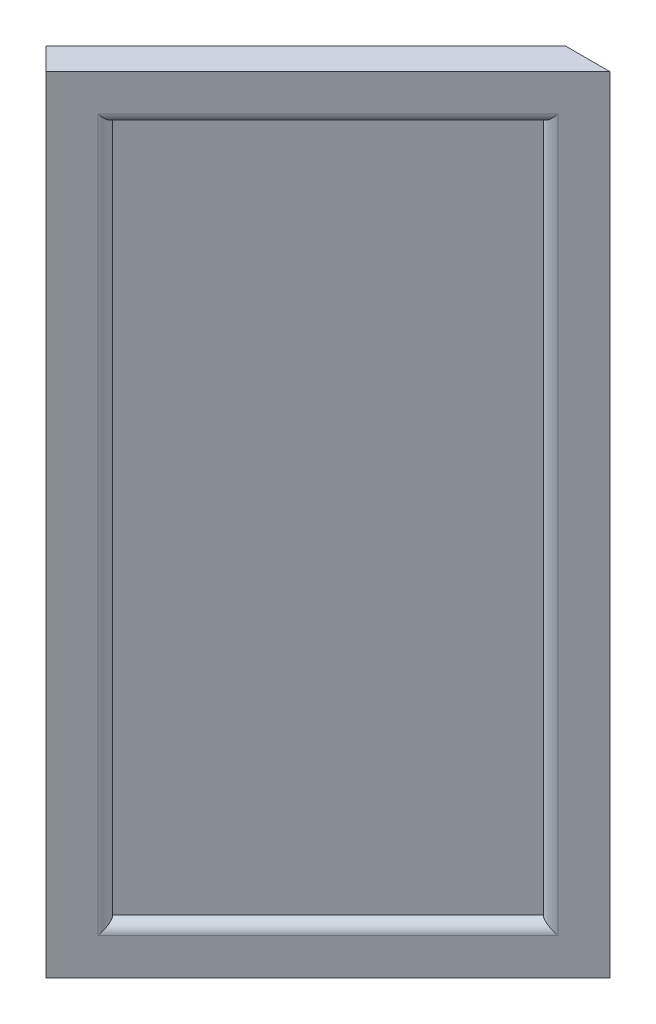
ISO-10303-21;
HEADER;
FILE_DESCRIPTION(('STEP AP214'),'2;1');
FILE_NAME('part.step','',(''),(''),'','','');
FILE_SCHEMA(('AUTOMOTIVE_DESIGN { 1 0 10303 214 1 1 1 1 }'));
ENDSEC;
DATA;
#1=APPLICATION_CONTEXT('core data for automotive mechanical design processes');
#2=APPLICATION_PROTOCOL_DEFINITION('international standard','automotive_design',2000,#1);
#3=PRODUCT_CONTEXT('',#1,'mechanical');
#4=PRODUCT('Part','Part','',(#3));
#5=PRODUCT_RELATED_PRODUCT_CATEGORY('part','',(#4));
#6=PRODUCT_DEFINITION_FORMATION('','',#4);
#7=PRODUCT_DEFINITION_CONTEXT('part definition',#1,'design');
#8=PRODUCT_DEFINITION('design','',#6,#7);
#9=PRODUCT_DEFINITION_SHAPE('','',#8);
#10=(LENGTH_UNIT() NAMED_UNIT(*) SI_UNIT(.MILLI.,.METRE.));
#11=(NAMED_UNIT(*) PLANE_ANGLE_UNIT() SI_UNIT($,.RADIAN.));
#12=(NAMED_UNIT(*) SI_UNIT($,.STERADIAN.) SOLID_ANGLE_UNIT());
#13=UNCERTAINTY_MEASURE_WITH_UNIT(LENGTH_MEASURE(1.E-05),#10,'distance_accuracy_value','');
#14=(GEOMETRIC_REPRESENTATION_CONTEXT(3) GLOBAL_UNCERTAINTY_ASSIGNED_CONTEXT((#13)) GLOBAL_UNIT_ASSIGNED_CONTEXT((#10,
#11,#12)) REPRESENTATION_CONTEXT('',''));
#15=CARTESIAN_POINT('',(0.,0.,0.));
#16=DIRECTION('',(0.,0.,1.));
#17=DIRECTION('',(1.,0.,0.));
#18=AXIS2_PLACEMENT_3D('',#15,#16,#17);
#19=CARTESIAN_POINT('',(13.4703841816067,2268.55502729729,-13.4703841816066));
#20=DIRECTION('',(0.70710678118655,0.,-0.707106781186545));
#21=DIRECTION('',(-0.707106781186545,0.,-0.70710678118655));
#22=AXIS2_PLACEMENT_3D('',#19,#20,#21);
#23=PLANE('',#22);
#24=DIRECTION('',(0.707106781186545,0.,0.70710678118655));
#25=VECTOR('',#24,1.);
#26=CARTESIAN_POINT('',(13.4703841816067,1765.3,-13.4703841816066));
#27=LINE('',#26,#25);
#28=CARTESIAN_POINT('',(697.729615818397,1765.3,670.788847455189));
#29=VERTEX_POINT('',#28);
#30=CARTESIAN_POINT('',(724.670384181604,1765.3,697.729615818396));
#31=VERTEX_POINT('',#30);
#32=EDGE_CURVE('E166',#29,#31,#27,.T.);
#33=ORIENTED_EDGE('',*,*,#32,.F.);
#34=DIRECTION('',(0.,-1.,0.));
#35=VECTOR('',#34,1.);
#36=CARTESIAN_POINT('',(697.729615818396,2268.55502729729,670.788847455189));
#37=LINE('',#36,#35);
#38=CARTESIAN_POINT('',(697.729615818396,812.8,670.788847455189));
#39=VERTEX_POINT('',#38);
#40=EDGE_CURVE('E140',#29,#39,#37,.T.);
#41=ORIENTED_EDGE('',*,*,#40,.T.);
#42=DIRECTION('',(0.707106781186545,0.,0.70710678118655));
#43=VECTOR('',#42,1.);
#44=CARTESIAN_POINT('',(13.4703841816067,812.8,-13.4703841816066));
#45=LINE('',#44,#43);
#46=CARTESIAN_POINT('',(724.670384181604,812.8,697.729615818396));
#47=VERTEX_POINT('',#46);
#48=EDGE_CURVE('E156',#39,#47,#45,.T.);
#49=ORIENTED_EDGE('',*,*,#48,.T.);
#50=DIRECTION('',(0.,-1.,0.));
#51=VECTOR('',#50,1.);
#52=CARTESIAN_POINT('',(724.670384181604,2268.55502729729,697.729615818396));
#53=LINE('',#52,#51);
#54=EDGE_CURVE('E155',#31,#47,#53,.T.);
#55=ORIENTED_EDGE('',*,*,#54,.F.);
#56=EDGE_LOOP('',(#33,#41,#49,#55));
#57=FACE_BOUND('',#56,.T.);
#58=ADVANCED_FACE('F49',(#57),#23,.F.);
#59=CARTESIAN_POINT('',(711.2,2268.55502729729,711.2));
#60=DIRECTION('',(-0.707106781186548,0.,-0.707106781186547));
#61=DIRECTION('',(-0.707106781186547,0.,0.707106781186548));
#62=AXIS2_PLACEMENT_3D('',#59,#60,#61);
#63=PLANE('',#62);
#64=DIRECTION('',(0.,-1.,0.));
#65=VECTOR('',#64,1.);
#66=CARTESIAN_POINT('',(756.101280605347,1720.85,666.298719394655));
#67=LINE('',#66,#65);
#68=CARTESIAN_POINT('',(756.101280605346,1720.85,666.298719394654));
#69=VERTEX_POINT('',#68);
#70=CARTESIAN_POINT('',(756.101280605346,857.25,666.298719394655));
#71=VERTEX_POINT('',#70);
#72=EDGE_CURVE('E126',#69,#71,#67,.T.);
#73=ORIENTED_EDGE('',*,*,#72,.F.);
#74=DIRECTION('',(-0.707106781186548,0.,0.707106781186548));
#75=VECTOR('',#74,1.);
#76=CARTESIAN_POINT('',(1035.36910357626,1720.85,387.030896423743));
#77=LINE('',#76,#75);
#78=CARTESIAN_POINT('',(1035.36910357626,1720.85,387.030896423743));
#79=VERTEX_POINT('',#78);
#80=EDGE_CURVE('E64',#79,#69,#77,.T.);
#81=ORIENTED_EDGE('',*,*,#80,.F.);
#82=DIRECTION('',(0.,1.,0.));
#83=VECTOR('',#82,1.);
#84=CARTESIAN_POINT('',(1035.36910357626,1720.85,387.030896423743));
#85=LINE('',#84,#83);
#86=CARTESIAN_POINT('',(1035.36910357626,857.25,387.030896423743));
#87=VERTEX_POINT('',#86);
#88=EDGE_CURVE('E133',#87,#79,#85,.T.);
#89=ORIENTED_EDGE('',*,*,#88,.F.);
#90=DIRECTION('',(0.707106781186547,0.,-0.707106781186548));
#91=VECTOR('',#90,1.);
#92=CARTESIAN_POINT('',(1035.36910357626,857.25,387.030896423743));
#93=LINE('',#92,#91);
#94=EDGE_CURVE('E117',#71,#87,#93,.T.);
#95=ORIENTED_EDGE('',*,*,#94,.F.);
#96=EDGE_LOOP('',(#73,#81,#89,#95));
#97=FACE_BOUND('',#96,.T.);
#98=DIRECTION('',(0.707106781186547,0.,-0.707106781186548));
#99=VECTOR('',#98,1.);
#100=CARTESIAN_POINT('',(711.2,1765.3,711.2));
#101=LINE('',#100,#99);
#102=CARTESIAN_POINT('',(1066.8,1765.3,355.6));
#103=VERTEX_POINT('',#102);
#104=EDGE_CURVE('E163',#31,#103,#101,.T.);
#105=ORIENTED_EDGE('',*,*,#104,.F.);
#106=ORIENTED_EDGE('',*,*,#54,.T.);
#107=DIRECTION('',(0.707106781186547,0.,-0.707106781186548));
#108=VECTOR('',#107,1.);
#109=CARTESIAN_POINT('',(711.2,812.8,711.2));
#110=LINE('',#109,#108);
#111=CARTESIAN_POINT('',(1066.8,812.8,355.6));
#112=VERTEX_POINT('',#111);
#113=EDGE_CURVE('E152',#47,#112,#110,.T.);
#114=ORIENTED_EDGE('',*,*,#113,.T.);
#115=DIRECTION('',(0.,-1.,0.));
#116=VECTOR('',#115,1.);
#117=CARTESIAN_POINT('',(1066.8,2268.55502729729,355.6));
#118=LINE('',#117,#116);
#119=EDGE_CURVE('E151',#103,#112,#118,.T.);
#120=ORIENTED_EDGE('',*,*,#119,.F.);
#121=EDGE_LOOP('',(#105,#106,#114,#120));
#122=FACE_BOUND('',#121,.T.);
#123=ADVANCED_FACE('F130',(#97,#122),#63,.F.);
#124=CARTESIAN_POINT('',(0.,2268.55502729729,355.6));
#125=DIRECTION('',(0.,0.,1.));
#126=DIRECTION('',(1.,0.,0.));
#127=AXIS2_PLACEMENT_3D('',#124,#125,#126);
#128=PLANE('',#127);
#129=DIRECTION('',(-1.,0.,0.));
#130=VECTOR('',#129,1.);
#131=CARTESIAN_POINT('',(0.,1765.3,355.6));
#132=LINE('',#131,#130);
#133=CARTESIAN_POINT('',(1012.91846327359,1765.3,355.6));
#134=VERTEX_POINT('',#133);
#135=EDGE_CURVE('E159',#103,#134,#132,.T.);
#136=ORIENTED_EDGE('',*,*,#135,.F.);
#137=ORIENTED_EDGE('',*,*,#119,.T.);
#138=DIRECTION('',(-1.,0.,0.));
#139=VECTOR('',#138,1.);
#140=CARTESIAN_POINT('',(0.,812.8,355.6));
#141=LINE('',#140,#139);
#142=CARTESIAN_POINT('',(1012.91846327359,812.8,355.6));
#143=VERTEX_POINT('',#142);
#144=EDGE_CURVE('E148',#112,#143,#141,.T.);
#145=ORIENTED_EDGE('',*,*,#144,.T.);
#146=DIRECTION('',(0.,-1.,0.));
#147=VECTOR('',#146,1.);
#148=CARTESIAN_POINT('',(1012.91846327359,2268.55502729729,355.6));
#149=LINE('',#148,#147);
#150=EDGE_CURVE('E147',#134,#143,#149,.T.);
#151=ORIENTED_EDGE('',*,*,#150,.F.);
#152=EDGE_LOOP('',(#136,#137,#145,#151));
#153=FACE_BOUND('',#152,.T.);
#154=ADVANCED_FACE('F200',(#153),#128,.F.);
#155=CARTESIAN_POINT('',(684.259231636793,2268.55502729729,684.259231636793));
#156=DIRECTION('',(0.707106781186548,0.,0.707106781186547));
#157=DIRECTION('',(0.707106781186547,0.,-0.707106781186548));
#158=AXIS2_PLACEMENT_3D('',#155,#156,#157);
#159=PLANE('',#158);
#160=DIRECTION('',(0.,1.,0.));
#161=VECTOR('',#160,1.);
#162=CARTESIAN_POINT('',(1008.42833521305,2268.55502729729,360.090128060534));
#163=LINE('',#162,#161);
#164=CARTESIAN_POINT('',(1008.42833521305,857.25,360.090128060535));
#165=VERTEX_POINT('',#164);
#166=CARTESIAN_POINT('',(1008.42833521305,1720.85,360.090128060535));
#167=VERTEX_POINT('',#166);
#168=EDGE_CURVE('E57',#165,#167,#163,.T.);
#169=ORIENTED_EDGE('',*,*,#168,.T.);
#170=DIRECTION('',(-0.707106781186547,0.,0.707106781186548));
#171=VECTOR('',#170,1.);
#172=CARTESIAN_POINT('',(684.259231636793,1720.85,684.259231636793));
#173=LINE('',#172,#171);
#174=CARTESIAN_POINT('',(729.160512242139,1720.85,639.357951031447));
#175=VERTEX_POINT('',#174);
#176=EDGE_CURVE('E12',#167,#175,#173,.T.);
#177=ORIENTED_EDGE('',*,*,#176,.T.);
#178=DIRECTION('',(0.,-1.,0.));
#179=VECTOR('',#178,1.);
#180=CARTESIAN_POINT('',(729.160512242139,2268.55502729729,639.357951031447));
#181=LINE('',#180,#179);
#182=CARTESIAN_POINT('',(729.160512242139,857.25,639.357951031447));
#183=VERTEX_POINT('',#182);
#184=EDGE_CURVE('E162',#175,#183,#181,.T.);
#185=ORIENTED_EDGE('',*,*,#184,.T.);
#186=DIRECTION('',(0.707106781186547,0.,-0.707106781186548));
#187=VECTOR('',#186,1.);
#188=CARTESIAN_POINT('',(684.259231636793,857.25,684.259231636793));
#189=LINE('',#188,#187);
#190=EDGE_CURVE('E120',#183,#165,#189,.T.);
#191=ORIENTED_EDGE('',*,*,#190,.T.);
#192=EDGE_LOOP('',(#169,#177,#185,#191));
#193=FACE_BOUND('',#192,.T.);
#194=DIRECTION('',(-0.707106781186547,0.,0.707106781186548));
#195=VECTOR('',#194,1.);
#196=CARTESIAN_POINT('',(684.259231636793,1765.3,684.259231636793));
#197=LINE('',#196,#195);
#198=EDGE_CURVE('E146',#134,#29,#197,.T.);
#199=ORIENTED_EDGE('',*,*,#198,.F.);
#200=ORIENTED_EDGE('',*,*,#150,.T.);
#201=DIRECTION('',(-0.707106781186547,0.,0.707106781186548));
#202=VECTOR('',#201,1.);
#203=CARTESIAN_POINT('',(684.259231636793,812.8,684.259231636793));
#204=LINE('',#203,#202);
#205=EDGE_CURVE('E143',#143,#39,#204,.T.);
#206=ORIENTED_EDGE('',*,*,#205,.T.);
#207=ORIENTED_EDGE('',*,*,#40,.F.);
#208=EDGE_LOOP('',(#199,#200,#206,#207));
#209=FACE_BOUND('',#208,.T.);
#210=ADVANCED_FACE('F178',(#193,#209),#159,.F.);
#211=CARTESIAN_POINT('',(0.,812.8,0.));
#212=DIRECTION('',(0.,1.,0.));
#213=DIRECTION('',(0.,0.,1.));
#214=AXIS2_PLACEMENT_3D('',#211,#212,#213);
#215=PLANE('',#214);
#216=ORIENTED_EDGE('',*,*,#48,.F.);
#217=ORIENTED_EDGE('',*,*,#205,.F.);
#218=ORIENTED_EDGE('',*,*,#144,.F.);
#219=ORIENTED_EDGE('',*,*,#113,.F.);
#220=EDGE_LOOP('',(#216,#217,#218,#219));
#221=FACE_BOUND('',#220,.T.);
#222=ADVANCED_FACE('F191',(#221),#215,.F.);
#223=CARTESIAN_POINT('',(0.,1765.3,0.));
#224=DIRECTION('',(0.,1.,0.));
#225=DIRECTION('',(0.,0.,1.));
#226=AXIS2_PLACEMENT_3D('',#223,#224,#225);
#227=PLANE('',#226);
#228=ORIENTED_EDGE('',*,*,#198,.T.);
#229=ORIENTED_EDGE('',*,*,#32,.T.);
#230=ORIENTED_EDGE('',*,*,#104,.T.);
#231=ORIENTED_EDGE('',*,*,#135,.T.);
#232=EDGE_LOOP('',(#228,#229,#230,#231));
#233=FACE_BOUND('',#232,.T.);
#234=ADVANCED_FACE('F51',(#233),#227,.T.);
#235=CARTESIAN_POINT('',(1004.83623276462,1720.85,356.498025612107));
#236=DIRECTION('',(0.,1.,0.));
#237=DIRECTION('',(0.,0.,1.));
#238=AXIS2_PLACEMENT_3D('',#235,#236,#237);
#239=PLANE('',#238);
#240=DIRECTION('',(0.707106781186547,0.,0.707106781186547));
#241=VECTOR('',#240,1.);
#242=CARTESIAN_POINT('',(1004.83623276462,1720.85,356.498025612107));
#243=LINE('',#242,#241);
#244=EDGE_CURVE('E138',#167,#79,#243,.T.);
#245=ORIENTED_EDGE('',*,*,#244,.T.);
#246=ORIENTED_EDGE('',*,*,#80,.T.);
#247=DIRECTION('',(0.707106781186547,0.,0.707106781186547));
#248=VECTOR('',#247,1.);
#249=CARTESIAN_POINT('',(725.568409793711,1720.85,635.76584858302));
#250=LINE('',#249,#248);
#251=EDGE_CURVE('E123',#175,#69,#250,.T.);
#252=ORIENTED_EDGE('',*,*,#251,.F.);
#253=ORIENTED_EDGE('',*,*,#176,.F.);
#254=EDGE_LOOP('',(#245,#246,#252,#253));
#255=FACE_BOUND('',#254,.T.);
#256=ADVANCED_FACE('F183',(#255),#239,.F.);
#257=CARTESIAN_POINT('',(1004.83623276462,1720.85,356.498025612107));
#258=DIRECTION('',(0.707106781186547,0.,-0.707106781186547));
#259=DIRECTION('',(-0.707106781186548,0.,-0.707106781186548));
#260=AXIS2_PLACEMENT_3D('',#257,#258,#259);
#261=PLANE('',#260);
#262=DIRECTION('',(0.707106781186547,0.,0.707106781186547));
#263=VECTOR('',#262,1.);
#264=CARTESIAN_POINT('',(1004.83623276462,857.25,356.498025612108));
#265=LINE('',#264,#263);
#266=EDGE_CURVE('E122',#165,#87,#265,.T.);
#267=ORIENTED_EDGE('',*,*,#266,.T.);
#268=ORIENTED_EDGE('',*,*,#88,.T.);
#269=ORIENTED_EDGE('',*,*,#244,.F.);
#270=ORIENTED_EDGE('',*,*,#168,.F.);
#271=EDGE_LOOP('',(#267,#268,#269,#270));
#272=FACE_BOUND('',#271,.T.);
#273=ADVANCED_FACE('F182',(#272),#261,.F.);
#274=CARTESIAN_POINT('',(1004.83623276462,857.25,356.498025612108));
#275=DIRECTION('',(0.,-1.,0.));
#276=DIRECTION('',(0.,0.,-1.));
#277=AXIS2_PLACEMENT_3D('',#274,#275,#276);
#278=PLANE('',#277);
#279=DIRECTION('',(0.707106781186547,0.,0.707106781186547));
#280=VECTOR('',#279,1.);
#281=CARTESIAN_POINT('',(725.568409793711,857.25,635.76584858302));
#282=LINE('',#281,#280);
#283=EDGE_CURVE('E72',#183,#71,#282,.T.);
#284=ORIENTED_EDGE('',*,*,#283,.T.);
#285=ORIENTED_EDGE('',*,*,#94,.T.);
#286=ORIENTED_EDGE('',*,*,#266,.F.);
#287=ORIENTED_EDGE('',*,*,#190,.F.);
#288=EDGE_LOOP('',(#284,#285,#286,#287));
#289=FACE_BOUND('',#288,.T.);
#290=ADVANCED_FACE('F114',(#289),#278,.F.);
#291=CARTESIAN_POINT('',(725.568409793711,1720.85,635.76584858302));
#292=DIRECTION('',(-0.707106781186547,0.,0.707106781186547));
#293=DIRECTION('',(0.707106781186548,0.,0.707106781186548));
#294=AXIS2_PLACEMENT_3D('',#291,#292,#293);
#295=PLANE('',#294);
#296=ORIENTED_EDGE('',*,*,#251,.T.);
#297=ORIENTED_EDGE('',*,*,#72,.T.);
#298=ORIENTED_EDGE('',*,*,#283,.F.);
#299=ORIENTED_EDGE('',*,*,#184,.F.);
#300=EDGE_LOOP('',(#296,#297,#298,#299));
#301=FACE_BOUND('',#300,.T.);
#302=ADVANCED_FACE('F127',(#301),#295,.F.);
#303=CLOSED_SHELL('',(#58,#123,#154,#210,#222,#234,#256,#273,#290,#302));
#304=MANIFOLD_SOLID_BREP('B2',#303);
#305=CARTESIAN_POINT('',(738.140768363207,1720.85,648.338207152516));
#306=DIRECTION('',(0.,1.,0.));
#307=DIRECTION('',(0.,0.,1.));
#308=AXIS2_PLACEMENT_3D('',#305,#306,#307);
#309=PLANE('',#308);
#310=DIRECTION('',(0.707106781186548,0.,-0.707106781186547));
#311=VECTOR('',#310,1.);
#312=CARTESIAN_POINT('',(729.160512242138,1720.85,639.357951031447));
#313=LINE('',#312,#311);
#314=CARTESIAN_POINT('',(729.160512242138,1720.85,639.357951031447));
#315=VERTEX_POINT('',#314);
#316=CARTESIAN_POINT('',(1008.42833521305,1720.85,360.090128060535));
#317=VERTEX_POINT('',#316);
#318=EDGE_CURVE('E376',#315,#317,#313,.T.);
#319=ORIENTED_EDGE('',*,*,#318,.F.);
#320=DIRECTION('',(-0.707106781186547,0.,-0.707106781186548));
#321=VECTOR('',#320,1.);
#322=CARTESIAN_POINT('',(738.140768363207,1720.85,648.338207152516));
#323=LINE('',#322,#321);
#324=CARTESIAN_POINT('',(738.140768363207,1720.85,648.338207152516));
#325=VERTEX_POINT('',#324);
#326=EDGE_CURVE('E47',#325,#315,#323,.T.);
#327=ORIENTED_EDGE('',*,*,#326,.F.);
#328=DIRECTION('',(0.707106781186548,0.,-0.707106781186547));
#329=VECTOR('',#328,1.);
#330=CARTESIAN_POINT('',(738.140768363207,1720.85,648.338207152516));
#331=LINE('',#330,#329);
#332=CARTESIAN_POINT('',(1017.40859133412,1720.85,369.070384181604));
#333=VERTEX_POINT('',#332);
#334=EDGE_CURVE('E377',#325,#333,#331,.T.);
#335=ORIENTED_EDGE('',*,*,#334,.T.);
#336=DIRECTION('',(-0.707106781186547,0.,-0.707106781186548));
#337=VECTOR('',#336,1.);
#338=CARTESIAN_POINT('',(1017.40859133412,1720.85,369.070384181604));
#339=LINE('',#338,#337);
#340=EDGE_CURVE('E338',#333,#317,#339,.T.);
#341=ORIENTED_EDGE('',*,*,#340,.T.);
#342=EDGE_LOOP('',(#319,#327,#335,#341));
#343=FACE_BOUND('',#342,.T.);
#344=ADVANCED_FACE('F288',(#343),#309,.T.);
#345=CARTESIAN_POINT('',(738.140768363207,1720.85,648.338207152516));
#346=DIRECTION('',(-0.707106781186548,0.,0.707106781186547));
#347=DIRECTION('',(0.707106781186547,0.,0.707106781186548));
#348=AXIS2_PLACEMENT_3D('',#345,#346,#347);
#349=PLANE('',#348);
#350=DIRECTION('',(0.,1.,0.));
#351=VECTOR('',#350,1.);
#352=CARTESIAN_POINT('',(729.160512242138,1720.85,639.357951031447));
#353=LINE('',#352,#351);
#354=CARTESIAN_POINT('',(729.160512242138,857.25,639.357951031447));
#355=VERTEX_POINT('',#354);
#356=EDGE_CURVE('E380',#355,#315,#353,.T.);
#357=ORIENTED_EDGE('',*,*,#356,.F.);
#358=DIRECTION('',(-0.707106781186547,0.,-0.707106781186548));
#359=VECTOR('',#358,1.);
#360=CARTESIAN_POINT('',(738.140768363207,857.25,648.338207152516));
#361=LINE('',#360,#359);
#362=CARTESIAN_POINT('',(738.140768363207,857.25,648.338207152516));
#363=VERTEX_POINT('',#362);
#364=EDGE_CURVE('E297',#363,#355,#361,.T.);
#365=ORIENTED_EDGE('',*,*,#364,.F.);
#366=DIRECTION('',(0.,1.,0.));
#367=VECTOR('',#366,1.);
#368=CARTESIAN_POINT('',(738.140768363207,1720.85,648.338207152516));
#369=LINE('',#368,#367);
#370=EDGE_CURVE('E385',#363,#325,#369,.T.);
#371=ORIENTED_EDGE('',*,*,#370,.T.);
#372=ORIENTED_EDGE('',*,*,#326,.T.);
#373=EDGE_LOOP('',(#357,#365,#371,#372));
#374=FACE_BOUND('',#373,.T.);
#375=ADVANCED_FACE('F408',(#374),#349,.T.);
#376=CARTESIAN_POINT('',(738.140768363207,857.25,648.338207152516));
#377=DIRECTION('',(0.,-1.,0.));
#378=DIRECTION('',(0.,0.,-1.));
#379=AXIS2_PLACEMENT_3D('',#376,#377,#378);
#380=PLANE('',#379);
#381=DIRECTION('',(-0.707106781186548,0.,0.707106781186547));
#382=VECTOR('',#381,1.);
#383=CARTESIAN_POINT('',(729.160512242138,857.25,639.357951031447));
#384=LINE('',#383,#382);
#385=CARTESIAN_POINT('',(1008.42833521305,857.25,360.090128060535));
#386=VERTEX_POINT('',#385);
#387=EDGE_CURVE('E390',#386,#355,#384,.T.);
#388=ORIENTED_EDGE('',*,*,#387,.F.);
#389=DIRECTION('',(-0.707106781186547,0.,-0.707106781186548));
#390=VECTOR('',#389,1.);
#391=CARTESIAN_POINT('',(1017.40859133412,857.25,369.070384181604));
#392=LINE('',#391,#390);
#393=CARTESIAN_POINT('',(1017.40859133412,857.25,369.070384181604));
#394=VERTEX_POINT('',#393);
#395=EDGE_CURVE('E395',#394,#386,#392,.T.);
#396=ORIENTED_EDGE('',*,*,#395,.F.);
#397=DIRECTION('',(-0.707106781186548,0.,0.707106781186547));
#398=VECTOR('',#397,1.);
#399=CARTESIAN_POINT('',(738.140768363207,857.25,648.338207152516));
#400=LINE('',#399,#398);
#401=EDGE_CURVE('E382',#394,#363,#400,.T.);
#402=ORIENTED_EDGE('',*,*,#401,.T.);
#403=ORIENTED_EDGE('',*,*,#364,.T.);
#404=EDGE_LOOP('',(#388,#396,#402,#403));
#405=FACE_BOUND('',#404,.T.);
#406=ADVANCED_FACE('F406',(#405),#380,.T.);
#407=CARTESIAN_POINT('',(1017.40859133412,1720.85,369.070384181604));
#408=DIRECTION('',(0.707106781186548,0.,-0.707106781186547));
#409=DIRECTION('',(-0.707106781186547,0.,-0.707106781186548));
#410=AXIS2_PLACEMENT_3D('',#407,#408,#409);
#411=PLANE('',#410);
#412=DIRECTION('',(0.,-1.,0.));
#413=VECTOR('',#412,1.);
#414=CARTESIAN_POINT('',(1008.42833521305,1720.85,360.090128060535));
#415=LINE('',#414,#413);
#416=EDGE_CURVE('E366',#317,#386,#415,.T.);
#417=ORIENTED_EDGE('',*,*,#416,.F.);
#418=ORIENTED_EDGE('',*,*,#340,.F.);
#419=DIRECTION('',(0.,-1.,0.));
#420=VECTOR('',#419,1.);
#421=CARTESIAN_POINT('',(1017.40859133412,1720.85,369.070384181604));
#422=LINE('',#421,#420);
#423=EDGE_CURVE('E379',#333,#394,#422,.T.);
#424=ORIENTED_EDGE('',*,*,#423,.T.);
#425=ORIENTED_EDGE('',*,*,#395,.T.);
#426=EDGE_LOOP('',(#417,#418,#424,#425));
#427=FACE_BOUND('',#426,.T.);
#428=ADVANCED_FACE('F402',(#427),#411,.T.);
#429=CARTESIAN_POINT('',(693.239487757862,0.,693.239487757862));
#430=DIRECTION('',(-0.707106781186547,0.,-0.707106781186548));
#431=DIRECTION('',(-0.707106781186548,0.,0.707106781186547));
#432=AXIS2_PLACEMENT_3D('',#429,#430,#431);
#433=PLANE('',#432);
#434=DIRECTION('',(0.707106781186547,0.,-0.707106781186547));
#435=VECTOR('',#434,1.);
#436=CARTESIAN_POINT('',(747.121024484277,1708.15,639.357951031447));
#437=LINE('',#436,#435);
#438=CARTESIAN_POINT('',(747.121024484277,1708.15,639.357951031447));
#439=VERTEX_POINT('',#438);
#440=CARTESIAN_POINT('',(1008.42833521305,1708.15,378.050640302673));
#441=VERTEX_POINT('',#440);
#442=EDGE_CURVE('E358',#439,#441,#437,.T.);
#443=ORIENTED_EDGE('',*,*,#442,.T.);
#444=DIRECTION('',(0.,-1.,0.));
#445=VECTOR('',#444,1.);
#446=CARTESIAN_POINT('',(1008.42833521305,1708.15,378.050640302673));
#447=LINE('',#446,#445);
#448=CARTESIAN_POINT('',(1008.42833521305,869.95,378.050640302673));
#449=VERTEX_POINT('',#448);
#450=EDGE_CURVE('E352',#441,#449,#447,.T.);
#451=ORIENTED_EDGE('',*,*,#450,.T.);
#452=DIRECTION('',(-0.707106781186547,0.,0.707106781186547));
#453=VECTOR('',#452,1.);
#454=CARTESIAN_POINT('',(747.121024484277,869.95,639.357951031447));
#455=LINE('',#454,#453);
#456=CARTESIAN_POINT('',(747.121024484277,869.95,639.357951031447));
#457=VERTEX_POINT('',#456);
#458=EDGE_CURVE('E356',#449,#457,#455,.T.);
#459=ORIENTED_EDGE('',*,*,#458,.T.);
#460=DIRECTION('',(0.,1.,0.));
#461=VECTOR('',#460,1.);
#462=CARTESIAN_POINT('',(747.121024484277,1708.15,639.357951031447));
#463=LINE('',#462,#461);
#464=EDGE_CURVE('E371',#457,#439,#463,.T.);
#465=ORIENTED_EDGE('',*,*,#464,.T.);
#466=EDGE_LOOP('',(#443,#451,#459,#465));
#467=FACE_BOUND('',#466,.T.);
#468=ORIENTED_EDGE('',*,*,#334,.F.);
#469=ORIENTED_EDGE('',*,*,#370,.F.);
#470=ORIENTED_EDGE('',*,*,#401,.F.);
#471=ORIENTED_EDGE('',*,*,#423,.F.);
#472=EDGE_LOOP('',(#468,#469,#470,#471));
#473=FACE_BOUND('',#472,.T.);
#474=ADVANCED_FACE('F354',(#467,#473),#433,.F.);
#475=CARTESIAN_POINT('',(747.121024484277,1720.85,639.357951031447));
#476=DIRECTION('',(-0.707106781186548,0.,0.707106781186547));
#477=DIRECTION('',(0.707106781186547,0.,0.707106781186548));
#478=AXIS2_PLACEMENT_3D('',#475,#476,#477);
#479=CYLINDRICAL_SURFACE('',#478,12.7);
#480=CARTESIAN_POINT('',(738.140768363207,1720.85,648.338207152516));
#481=DIRECTION('',(-0.5,-0.707106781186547,0.5));
#482=DIRECTION('',(0.5,-0.707106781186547,-0.5));
#483=AXIS2_PLACEMENT_3D('',#480,#481,#482);
#484=ELLIPSE('',#483,17.9605122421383,12.7);
#485=EDGE_CURVE('E368',#315,#439,#484,.T.);
#486=ORIENTED_EDGE('',*,*,#485,.F.);
#487=ORIENTED_EDGE('',*,*,#318,.T.);
#488=CARTESIAN_POINT('',(1017.40859133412,1720.85,369.070384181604));
#489=DIRECTION('',(-0.5,0.707106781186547,0.5));
#490=DIRECTION('',(0.5,0.707106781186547,-0.5));
#491=AXIS2_PLACEMENT_3D('',#488,#489,#490);
#492=ELLIPSE('',#491,17.9605122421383,12.7);
#493=EDGE_CURVE('E292',#441,#317,#492,.F.);
#494=ORIENTED_EDGE('',*,*,#493,.F.);
#495=ORIENTED_EDGE('',*,*,#442,.F.);
#496=EDGE_LOOP('',(#486,#487,#494,#495));
#497=FACE_BOUND('',#496,.T.);
#498=ADVANCED_FACE('F290',(#497),#479,.T.);
#499=CARTESIAN_POINT('',(1017.40859133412,1708.15,369.070384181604));
#500=DIRECTION('',(0.,1.,0.));
#501=DIRECTION('',(0.,0.,1.));
#502=AXIS2_PLACEMENT_3D('',#499,#500,#501);
#503=CYLINDRICAL_SURFACE('',#502,12.7);
#504=ORIENTED_EDGE('',*,*,#493,.T.);
#505=ORIENTED_EDGE('',*,*,#416,.T.);
#506=CARTESIAN_POINT('',(1017.40859133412,857.25,369.070384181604));
#507=DIRECTION('',(0.5,0.707106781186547,-0.5));
#508=DIRECTION('',(0.5,-0.707106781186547,-0.5));
#509=AXIS2_PLACEMENT_3D('',#506,#507,#508);
#510=ELLIPSE('',#509,17.9605122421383,12.7);
#511=EDGE_CURVE('E364',#449,#386,#510,.F.);
#512=ORIENTED_EDGE('',*,*,#511,.F.);
#513=ORIENTED_EDGE('',*,*,#450,.F.);
#514=EDGE_LOOP('',(#504,#505,#512,#513));
#515=FACE_BOUND('',#514,.T.);
#516=ADVANCED_FACE('F365',(#515),#503,.T.);
#517=CARTESIAN_POINT('',(738.140768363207,1708.15,648.338207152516));
#518=DIRECTION('',(0.,-1.,0.));
#519=DIRECTION('',(0.,0.,-1.));
#520=AXIS2_PLACEMENT_3D('',#517,#518,#519);
#521=CYLINDRICAL_SURFACE('',#520,12.7);
#522=ORIENTED_EDGE('',*,*,#485,.T.);
#523=ORIENTED_EDGE('',*,*,#464,.F.);
#524=CARTESIAN_POINT('',(738.140768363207,857.25,648.338207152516));
#525=DIRECTION('',(0.5,-0.707106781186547,-0.5));
#526=DIRECTION('',(0.5,0.707106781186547,-0.5));
#527=AXIS2_PLACEMENT_3D('',#524,#525,#526);
#528=ELLIPSE('',#527,17.9605122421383,12.7);
#529=EDGE_CURVE('E305',#355,#457,#528,.T.);
#530=ORIENTED_EDGE('',*,*,#529,.F.);
#531=ORIENTED_EDGE('',*,*,#356,.T.);
#532=EDGE_LOOP('',(#522,#523,#530,#531));
#533=FACE_BOUND('',#532,.T.);
#534=ADVANCED_FACE('F407',(#533),#521,.T.);
#535=CARTESIAN_POINT('',(747.121024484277,857.25,639.357951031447));
#536=DIRECTION('',(0.707106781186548,0.,-0.707106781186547));
#537=DIRECTION('',(-0.707106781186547,0.,-0.707106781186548));
#538=AXIS2_PLACEMENT_3D('',#535,#536,#537);
#539=CYLINDRICAL_SURFACE('',#538,12.7);
#540=ORIENTED_EDGE('',*,*,#511,.T.);
#541=ORIENTED_EDGE('',*,*,#387,.T.);
#542=ORIENTED_EDGE('',*,*,#529,.T.);
#543=ORIENTED_EDGE('',*,*,#458,.F.);
#544=EDGE_LOOP('',(#540,#541,#542,#543));
#545=FACE_BOUND('',#544,.T.);
#546=ADVANCED_FACE('F370',(#545),#539,.T.);
#547=CLOSED_SHELL('',(#344,#375,#406,#428,#474,#498,#516,#534,#546));
#548=MANIFOLD_SOLID_BREP('B6',#547);
#549=CARTESIAN_POINT('',(747.121024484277,857.25,657.318463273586));
#550=DIRECTION('',(0.707106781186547,0.,-0.707106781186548));
#551=DIRECTION('',(-0.707106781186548,0.,-0.707106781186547));
#552=AXIS2_PLACEMENT_3D('',#549,#550,#551);
#553=PLANE('',#552);
#554=DIRECTION('',(0.,-1.,0.));
#555=VECTOR('',#554,1.);
#556=CARTESIAN_POINT('',(738.140768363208,857.25,648.338207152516));
#557=LINE('',#556,#555);
#558=CARTESIAN_POINT('',(738.140768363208,1720.85,648.338207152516));
#559=VERTEX_POINT('',#558);
#560=CARTESIAN_POINT('',(738.140768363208,857.25,648.338207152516));
#561=VERTEX_POINT('',#560);
#562=EDGE_CURVE('E555',#559,#561,#557,.T.);
#563=ORIENTED_EDGE('',*,*,#562,.T.);
#564=DIRECTION('',(-0.707106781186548,0.,-0.707106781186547));
#565=VECTOR('',#564,1.);
#566=CARTESIAN_POINT('',(747.121024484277,857.25,657.318463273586));
#567=LINE('',#566,#565);
#568=CARTESIAN_POINT('',(747.121024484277,857.25,657.318463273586));
#569=VERTEX_POINT('',#568);
#570=EDGE_CURVE('E286',#569,#561,#567,.T.);
#571=ORIENTED_EDGE('',*,*,#570,.F.);
#572=DIRECTION('',(0.,-1.,0.));
#573=VECTOR('',#572,1.);
#574=CARTESIAN_POINT('',(747.121024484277,857.25,657.318463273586));
#575=LINE('',#574,#573);
#576=CARTESIAN_POINT('',(747.121024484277,1720.85,657.318463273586));
#577=VERTEX_POINT('',#576);
#578=EDGE_CURVE('E543',#577,#569,#575,.T.);
#579=ORIENTED_EDGE('',*,*,#578,.F.);
#580=DIRECTION('',(-0.707106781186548,0.,-0.707106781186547));
#581=VECTOR('',#580,1.);
#582=CARTESIAN_POINT('',(747.121024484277,1720.85,657.318463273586));
#583=LINE('',#582,#581);
#584=EDGE_CURVE('E551',#577,#559,#583,.T.);
#585=ORIENTED_EDGE('',*,*,#584,.T.);
#586=EDGE_LOOP('',(#563,#571,#579,#585));
#587=FACE_BOUND('',#586,.T.);
#588=ADVANCED_FACE('F492',(#587),#553,.F.);
#589=CARTESIAN_POINT('',(747.121024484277,857.25,657.318463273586));
#590=DIRECTION('',(0.,1.,0.));
#591=DIRECTION('',(0.,0.,1.));
#592=AXIS2_PLACEMENT_3D('',#589,#590,#591);
#593=PLANE('',#592);
#594=DIRECTION('',(0.707106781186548,0.,-0.707106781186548));
#595=VECTOR('',#594,1.);
#596=CARTESIAN_POINT('',(738.140768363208,857.25,648.338207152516));
#597=LINE('',#596,#595);
#598=CARTESIAN_POINT('',(1017.40859133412,857.25,369.070384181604));
#599=VERTEX_POINT('',#598);
#600=EDGE_CURVE('E547',#561,#599,#597,.T.);
#601=ORIENTED_EDGE('',*,*,#600,.T.);
#602=DIRECTION('',(-0.707106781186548,0.,-0.707106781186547));
#603=VECTOR('',#602,1.);
#604=CARTESIAN_POINT('',(1026.38884745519,857.25,378.050640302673));
#605=LINE('',#604,#603);
#606=CARTESIAN_POINT('',(1026.38884745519,857.25,378.050640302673));
#607=VERTEX_POINT('',#606);
#608=EDGE_CURVE('E500',#607,#599,#605,.T.);
#609=ORIENTED_EDGE('',*,*,#608,.F.);
#610=DIRECTION('',(0.707106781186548,0.,-0.707106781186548));
#611=VECTOR('',#610,1.);
#612=CARTESIAN_POINT('',(747.121024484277,857.25,657.318463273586));
#613=LINE('',#612,#611);
#614=EDGE_CURVE('E538',#569,#607,#613,.T.);
#615=ORIENTED_EDGE('',*,*,#614,.F.);
#616=ORIENTED_EDGE('',*,*,#570,.T.);
#617=EDGE_LOOP('',(#601,#609,#615,#616));
#618=FACE_BOUND('',#617,.T.);
#619=ADVANCED_FACE('F546',(#618),#593,.F.);
#620=CARTESIAN_POINT('',(1026.38884745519,857.25,378.050640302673));
#621=DIRECTION('',(-0.707106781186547,0.,0.707106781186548));
#622=DIRECTION('',(0.707106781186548,0.,0.707106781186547));
#623=AXIS2_PLACEMENT_3D('',#620,#621,#622);
#624=PLANE('',#623);
#625=DIRECTION('',(0.,1.,0.));
#626=VECTOR('',#625,1.);
#627=CARTESIAN_POINT('',(1017.40859133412,857.25,369.070384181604));
#628=LINE('',#627,#626);
#629=CARTESIAN_POINT('',(1017.40859133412,1720.85,369.070384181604));
#630=VERTEX_POINT('',#629);
#631=EDGE_CURVE('E525',#599,#630,#628,.T.);
#632=ORIENTED_EDGE('',*,*,#631,.T.);
#633=DIRECTION('',(-0.707106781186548,0.,-0.707106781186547));
#634=VECTOR('',#633,1.);
#635=CARTESIAN_POINT('',(1026.38884745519,1720.85,378.050640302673));
#636=LINE('',#635,#634);
#637=CARTESIAN_POINT('',(1026.38884745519,1720.85,378.050640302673));
#638=VERTEX_POINT('',#637);
#639=EDGE_CURVE('E548',#638,#630,#636,.T.);
#640=ORIENTED_EDGE('',*,*,#639,.F.);
#641=DIRECTION('',(0.,1.,0.));
#642=VECTOR('',#641,1.);
#643=CARTESIAN_POINT('',(1026.38884745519,857.25,378.050640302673));
#644=LINE('',#643,#642);
#645=EDGE_CURVE('E541',#607,#638,#644,.T.);
#646=ORIENTED_EDGE('',*,*,#645,.F.);
#647=ORIENTED_EDGE('',*,*,#608,.T.);
#648=EDGE_LOOP('',(#632,#640,#646,#647));
#649=FACE_BOUND('',#648,.T.);
#650=ADVANCED_FACE('F549',(#649),#624,.F.);
#651=CARTESIAN_POINT('',(747.121024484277,1720.85,657.318463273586));
#652=DIRECTION('',(0.,-1.,0.));
#653=DIRECTION('',(0.,0.,-1.));
#654=AXIS2_PLACEMENT_3D('',#651,#652,#653);
#655=PLANE('',#654);
#656=DIRECTION('',(-0.707106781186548,0.,0.707106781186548));
#657=VECTOR('',#656,1.);
#658=CARTESIAN_POINT('',(738.140768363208,1720.85,648.338207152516));
#659=LINE('',#658,#657);
#660=EDGE_CURVE('E531',#630,#559,#659,.T.);
#661=ORIENTED_EDGE('',*,*,#660,.T.);
#662=ORIENTED_EDGE('',*,*,#584,.F.);
#663=DIRECTION('',(-0.707106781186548,0.,0.707106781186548));
#664=VECTOR('',#663,1.);
#665=CARTESIAN_POINT('',(747.121024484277,1720.85,657.318463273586));
#666=LINE('',#665,#664);
#667=EDGE_CURVE('E508',#638,#577,#666,.T.);
#668=ORIENTED_EDGE('',*,*,#667,.F.);
#669=ORIENTED_EDGE('',*,*,#639,.T.);
#670=EDGE_LOOP('',(#661,#662,#668,#669));
#671=FACE_BOUND('',#670,.T.);
#672=ADVANCED_FACE('F562',(#671),#655,.F.);
#673=CARTESIAN_POINT('',(702.219743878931,0.,702.219743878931));
#674=DIRECTION('',(-0.707106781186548,0.,-0.707106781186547));
#675=DIRECTION('',(-0.707106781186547,0.,0.707106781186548));
#676=AXIS2_PLACEMENT_3D('',#673,#674,#675);
#677=PLANE('',#676);
#678=ORIENTED_EDGE('',*,*,#578,.T.);
#679=ORIENTED_EDGE('',*,*,#614,.T.);
#680=ORIENTED_EDGE('',*,*,#645,.T.);
#681=ORIENTED_EDGE('',*,*,#667,.T.);
#682=EDGE_LOOP('',(#678,#679,#680,#681));
#683=FACE_BOUND('',#682,.T.);
#684=ADVANCED_FACE('F539',(#683),#677,.F.);
#685=CARTESIAN_POINT('',(693.239487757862,0.,693.239487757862));
#686=DIRECTION('',(-0.707106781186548,0.,-0.707106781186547));
#687=DIRECTION('',(-0.707106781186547,0.,0.707106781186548));
#688=AXIS2_PLACEMENT_3D('',#685,#686,#687);
#689=PLANE('',#688);
#690=ORIENTED_EDGE('',*,*,#562,.F.);
#691=ORIENTED_EDGE('',*,*,#660,.F.);
#692=ORIENTED_EDGE('',*,*,#631,.F.);
#693=ORIENTED_EDGE('',*,*,#600,.F.);
#694=EDGE_LOOP('',(#690,#691,#692,#693));
#695=FACE_BOUND('',#694,.T.);
#696=ADVANCED_FACE('F565',(#695),#689,.T.);
#697=CLOSED_SHELL('',(#588,#619,#650,#672,#684,#696));
#698=MANIFOLD_SOLID_BREP('B41',#697);
#699=CARTESIAN_POINT('',(747.121024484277,857.25,657.318463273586));
#700=DIRECTION('',(-0.707106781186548,0.,0.707106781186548));
#701=DIRECTION('',(0.707106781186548,0.,0.707106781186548));
#702=AXIS2_PLACEMENT_3D('',#699,#700,#701);
#703=PLANE('',#702);
#704=DIRECTION('',(0.,-1.,0.));
#705=VECTOR('',#704,1.);
#706=CARTESIAN_POINT('',(756.101280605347,857.25,666.298719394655));
#707=LINE('',#706,#705);
#708=CARTESIAN_POINT('',(756.101280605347,1720.85,666.298719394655));
#709=VERTEX_POINT('',#708);
#710=CARTESIAN_POINT('',(756.101280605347,857.25,666.298719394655));
#711=VERTEX_POINT('',#710);
#712=EDGE_CURVE('E695',#709,#711,#707,.T.);
#713=ORIENTED_EDGE('',*,*,#712,.F.);
#714=DIRECTION('',(0.707106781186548,0.,0.707106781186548));
#715=VECTOR('',#714,1.);
#716=CARTESIAN_POINT('',(747.121024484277,1720.85,657.318463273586));
#717=LINE('',#716,#715);
#718=CARTESIAN_POINT('',(747.121024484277,1720.85,657.318463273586));
#719=VERTEX_POINT('',#718);
#720=EDGE_CURVE('E490',#719,#709,#717,.T.);
#721=ORIENTED_EDGE('',*,*,#720,.F.);
#722=DIRECTION('',(0.,-1.,0.));
#723=VECTOR('',#722,1.);
#724=CARTESIAN_POINT('',(747.121024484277,857.25,657.318463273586));
#725=LINE('',#724,#723);
#726=CARTESIAN_POINT('',(747.121024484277,857.25,657.318463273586));
#727=VERTEX_POINT('',#726);
#728=EDGE_CURVE('E710',#719,#727,#725,.T.);
#729=ORIENTED_EDGE('',*,*,#728,.T.);
#730=DIRECTION('',(0.707106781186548,0.,0.707106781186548));
#731=VECTOR('',#730,1.);
#732=CARTESIAN_POINT('',(747.121024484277,857.25,657.318463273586));
#733=LINE('',#732,#731);
#734=EDGE_CURVE('E665',#727,#711,#733,.T.);
#735=ORIENTED_EDGE('',*,*,#734,.T.);
#736=EDGE_LOOP('',(#713,#721,#729,#735));
#737=FACE_BOUND('',#736,.T.);
#738=ADVANCED_FACE('F615',(#737),#703,.T.);
#739=CARTESIAN_POINT('',(747.121024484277,1720.85,657.318463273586));
#740=DIRECTION('',(0.,1.,0.));
#741=DIRECTION('',(0.,0.,1.));
#742=AXIS2_PLACEMENT_3D('',#739,#740,#741);
#743=PLANE('',#742);
#744=DIRECTION('',(-0.707106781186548,0.,0.707106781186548));
#745=VECTOR('',#744,1.);
#746=CARTESIAN_POINT('',(756.101280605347,1720.85,666.298719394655));
#747=LINE('',#746,#745);
#748=CARTESIAN_POINT('',(1035.36910357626,1720.85,387.030896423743));
#749=VERTEX_POINT('',#748);
#750=EDGE_CURVE('E707',#749,#709,#747,.T.);
#751=ORIENTED_EDGE('',*,*,#750,.F.);
#752=DIRECTION('',(0.707106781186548,0.,0.707106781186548));
#753=VECTOR('',#752,1.);
#754=CARTESIAN_POINT('',(1026.38884745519,1720.85,378.050640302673));
#755=LINE('',#754,#753);
#756=CARTESIAN_POINT('',(1026.38884745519,1720.85,378.050640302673));
#757=VERTEX_POINT('',#756);
#758=EDGE_CURVE('E624',#757,#749,#755,.T.);
#759=ORIENTED_EDGE('',*,*,#758,.F.);
#760=DIRECTION('',(-0.707106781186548,0.,0.707106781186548));
#761=VECTOR('',#760,1.);
#762=CARTESIAN_POINT('',(747.121024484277,1720.85,657.318463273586));
#763=LINE('',#762,#761);
#764=EDGE_CURVE('E703',#757,#719,#763,.T.);
#765=ORIENTED_EDGE('',*,*,#764,.T.);
#766=ORIENTED_EDGE('',*,*,#720,.T.);
#767=EDGE_LOOP('',(#751,#759,#765,#766));
#768=FACE_BOUND('',#767,.T.);
#769=ADVANCED_FACE('F731',(#768),#743,.T.);
#770=CARTESIAN_POINT('',(1026.38884745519,857.25,378.050640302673));
#771=DIRECTION('',(0.707106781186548,0.,-0.707106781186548));
#772=DIRECTION('',(-0.707106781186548,0.,-0.707106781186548));
#773=AXIS2_PLACEMENT_3D('',#770,#771,#772);
#774=PLANE('',#773);
#775=DIRECTION('',(0.,1.,0.));
#776=VECTOR('',#775,1.);
#777=CARTESIAN_POINT('',(1035.36910357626,857.25,387.030896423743));
#778=LINE('',#777,#776);
#779=CARTESIAN_POINT('',(1035.36910357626,857.25,387.030896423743));
#780=VERTEX_POINT('',#779);
#781=EDGE_CURVE('E711',#780,#749,#778,.T.);
#782=ORIENTED_EDGE('',*,*,#781,.F.);
#783=DIRECTION('',(0.707106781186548,0.,0.707106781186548));
#784=VECTOR('',#783,1.);
#785=CARTESIAN_POINT('',(1026.38884745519,857.25,378.050640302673));
#786=LINE('',#785,#784);
#787=CARTESIAN_POINT('',(1026.38884745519,857.25,378.050640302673));
#788=VERTEX_POINT('',#787);
#789=EDGE_CURVE('E702',#788,#780,#786,.T.);
#790=ORIENTED_EDGE('',*,*,#789,.F.);
#791=DIRECTION('',(0.,1.,0.));
#792=VECTOR('',#791,1.);
#793=CARTESIAN_POINT('',(1026.38884745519,857.25,378.050640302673));
#794=LINE('',#793,#792);
#795=EDGE_CURVE('E718',#788,#757,#794,.T.);
#796=ORIENTED_EDGE('',*,*,#795,.T.);
#797=ORIENTED_EDGE('',*,*,#758,.T.);
#798=EDGE_LOOP('',(#782,#790,#796,#797));
#799=FACE_BOUND('',#798,.T.);
#800=ADVANCED_FACE('F735',(#799),#774,.T.);
#801=CARTESIAN_POINT('',(747.121024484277,857.25,657.318463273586));
#802=DIRECTION('',(0.,-1.,0.));
#803=DIRECTION('',(0.,0.,-1.));
#804=AXIS2_PLACEMENT_3D('',#801,#802,#803);
#805=PLANE('',#804);
#806=DIRECTION('',(0.707106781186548,0.,-0.707106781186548));
#807=VECTOR('',#806,1.);
#808=CARTESIAN_POINT('',(756.101280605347,857.25,666.298719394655));
#809=LINE('',#808,#807);
#810=EDGE_CURVE('E714',#711,#780,#809,.T.);
#811=ORIENTED_EDGE('',*,*,#810,.F.);
#812=ORIENTED_EDGE('',*,*,#734,.F.);
#813=DIRECTION('',(0.707106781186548,0.,-0.707106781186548));
#814=VECTOR('',#813,1.);
#815=CARTESIAN_POINT('',(747.121024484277,857.25,657.318463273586));
#816=LINE('',#815,#814);
#817=EDGE_CURVE('E721',#727,#788,#816,.T.);
#818=ORIENTED_EDGE('',*,*,#817,.T.);
#819=ORIENTED_EDGE('',*,*,#789,.T.);
#820=EDGE_LOOP('',(#811,#812,#818,#819));
#821=FACE_BOUND('',#820,.T.);
#822=ADVANCED_FACE('F736',(#821),#805,.T.);
#823=CARTESIAN_POINT('',(702.219743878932,0.,702.219743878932));
#824=DIRECTION('',(-0.707106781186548,0.,-0.707106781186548));
#825=DIRECTION('',(-0.707106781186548,0.,0.707106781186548));
#826=AXIS2_PLACEMENT_3D('',#823,#824,#825);
#827=PLANE('',#826);
#828=DIRECTION('',(0.,-1.,0.));
#829=VECTOR('',#828,1.);
#830=CARTESIAN_POINT('',(756.101280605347,869.95,648.338207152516));
#831=LINE('',#830,#829);
#832=CARTESIAN_POINT('',(756.101280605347,1708.15,648.338207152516));
#833=VERTEX_POINT('',#832);
#834=CARTESIAN_POINT('',(756.101280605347,869.95,648.338207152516));
#835=VERTEX_POINT('',#834);
#836=EDGE_CURVE('E676',#833,#835,#831,.T.);
#837=ORIENTED_EDGE('',*,*,#836,.T.);
#838=DIRECTION('',(0.707106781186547,0.,-0.707106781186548));
#839=VECTOR('',#838,1.);
#840=CARTESIAN_POINT('',(756.101280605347,869.95,648.338207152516));
#841=LINE('',#840,#839);
#842=CARTESIAN_POINT('',(1017.40859133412,869.95,387.030896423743));
#843=VERTEX_POINT('',#842);
#844=EDGE_CURVE('E632',#835,#843,#841,.T.);
#845=ORIENTED_EDGE('',*,*,#844,.T.);
#846=DIRECTION('',(0.,1.,0.));
#847=VECTOR('',#846,1.);
#848=CARTESIAN_POINT('',(1017.40859133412,869.95,387.030896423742));
#849=LINE('',#848,#847);
#850=CARTESIAN_POINT('',(1017.40859133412,1708.15,387.030896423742));
#851=VERTEX_POINT('',#850);
#852=EDGE_CURVE('E692',#843,#851,#849,.T.);
#853=ORIENTED_EDGE('',*,*,#852,.T.);
#854=DIRECTION('',(-0.707106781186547,0.,0.707106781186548));
#855=VECTOR('',#854,1.);
#856=CARTESIAN_POINT('',(756.101280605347,1708.15,648.338207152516));
#857=LINE('',#856,#855);
#858=EDGE_CURVE('E680',#851,#833,#857,.T.);
#859=ORIENTED_EDGE('',*,*,#858,.T.);
#860=EDGE_LOOP('',(#837,#845,#853,#859));
#861=FACE_BOUND('',#860,.T.);
#862=ORIENTED_EDGE('',*,*,#728,.F.);
#863=ORIENTED_EDGE('',*,*,#764,.F.);
#864=ORIENTED_EDGE('',*,*,#795,.F.);
#865=ORIENTED_EDGE('',*,*,#817,.F.);
#866=EDGE_LOOP('',(#862,#863,#864,#865));
#867=FACE_BOUND('',#866,.T.);
#868=ADVANCED_FACE('F677',(#861,#867),#827,.T.);
#869=CARTESIAN_POINT('',(756.101280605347,857.25,648.338207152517));
#870=DIRECTION('',(0.707106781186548,0.,-0.707106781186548));
#871=DIRECTION('',(-0.707106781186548,0.,-0.707106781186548));
#872=AXIS2_PLACEMENT_3D('',#869,#870,#871);
#873=CYLINDRICAL_SURFACE('',#872,12.7);
#874=CARTESIAN_POINT('',(747.121024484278,857.25,657.318463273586));
#875=DIRECTION('',(0.5,-0.707106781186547,-0.5));
#876=DIRECTION('',(-0.5,-0.707106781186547,0.5));
#877=AXIS2_PLACEMENT_3D('',#874,#875,#876);
#878=ELLIPSE('',#877,17.9605122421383,12.7);
#879=EDGE_CURVE('E688',#711,#835,#878,.F.);
#880=ORIENTED_EDGE('',*,*,#879,.F.);
#881=ORIENTED_EDGE('',*,*,#810,.T.);
#882=CARTESIAN_POINT('',(1026.38884745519,857.25,378.050640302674));
#883=DIRECTION('',(0.5,0.707106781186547,-0.5));
#884=DIRECTION('',(-0.5,0.707106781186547,0.5));
#885=AXIS2_PLACEMENT_3D('',#882,#883,#884);
#886=ELLIPSE('',#885,17.9605122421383,12.7);
#887=EDGE_CURVE('E619',#843,#780,#886,.T.);
#888=ORIENTED_EDGE('',*,*,#887,.F.);
#889=ORIENTED_EDGE('',*,*,#844,.F.);
#890=EDGE_LOOP('',(#880,#881,#888,#889));
#891=FACE_BOUND('',#890,.T.);
#892=ADVANCED_FACE('F617',(#891),#873,.T.);
#893=CARTESIAN_POINT('',(1026.38884745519,869.95,378.050640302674));
#894=DIRECTION('',(0.,1.,0.));
#895=DIRECTION('',(0.,0.,1.));
#896=AXIS2_PLACEMENT_3D('',#893,#894,#895);
#897=CYLINDRICAL_SURFACE('',#896,12.7);
#898=ORIENTED_EDGE('',*,*,#887,.T.);
#899=ORIENTED_EDGE('',*,*,#781,.T.);
#900=CARTESIAN_POINT('',(1026.38884745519,1720.85,378.050640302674));
#901=DIRECTION('',(-0.5,0.707106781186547,0.5));
#902=DIRECTION('',(-0.5,-0.707106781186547,0.5));
#903=AXIS2_PLACEMENT_3D('',#900,#901,#902);
#904=ELLIPSE('',#903,17.9605122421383,12.7);
#905=EDGE_CURVE('E696',#851,#749,#904,.T.);
#906=ORIENTED_EDGE('',*,*,#905,.F.);
#907=ORIENTED_EDGE('',*,*,#852,.F.);
#908=EDGE_LOOP('',(#898,#899,#906,#907));
#909=FACE_BOUND('',#908,.T.);
#910=ADVANCED_FACE('F727',(#909),#897,.T.);
#911=CARTESIAN_POINT('',(747.121024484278,869.95,657.318463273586));
#912=DIRECTION('',(0.,-1.,0.));
#913=DIRECTION('',(0.,0.,-1.));
#914=AXIS2_PLACEMENT_3D('',#911,#912,#913);
#915=CYLINDRICAL_SURFACE('',#914,12.7);
#916=ORIENTED_EDGE('',*,*,#879,.T.);
#917=ORIENTED_EDGE('',*,*,#836,.F.);
#918=CARTESIAN_POINT('',(747.121024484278,1720.85,657.318463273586));
#919=DIRECTION('',(-0.5,-0.707106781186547,0.5));
#920=DIRECTION('',(-0.5,0.707106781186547,0.5));
#921=AXIS2_PLACEMENT_3D('',#918,#919,#920);
#922=ELLIPSE('',#921,17.9605122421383,12.7);
#923=EDGE_CURVE('E697',#709,#833,#922,.F.);
#924=ORIENTED_EDGE('',*,*,#923,.F.);
#925=ORIENTED_EDGE('',*,*,#712,.T.);
#926=EDGE_LOOP('',(#916,#917,#924,#925));
#927=FACE_BOUND('',#926,.T.);
#928=ADVANCED_FACE('F694',(#927),#915,.T.);
#929=CARTESIAN_POINT('',(756.101280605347,1720.85,648.338207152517));
#930=DIRECTION('',(-0.707106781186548,0.,0.707106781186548));
#931=DIRECTION('',(0.707106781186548,0.,0.707106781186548));
#932=AXIS2_PLACEMENT_3D('',#929,#930,#931);
#933=CYLINDRICAL_SURFACE('',#932,12.7);
#934=ORIENTED_EDGE('',*,*,#905,.T.);
#935=ORIENTED_EDGE('',*,*,#750,.T.);
#936=ORIENTED_EDGE('',*,*,#923,.T.);
#937=ORIENTED_EDGE('',*,*,#858,.F.);
#938=EDGE_LOOP('',(#934,#935,#936,#937));
#939=FACE_BOUND('',#938,.T.);
#940=ADVANCED_FACE('F730',(#939),#933,.T.);
#941=CLOSED_SHELL('',(#738,#769,#800,#822,#868,#892,#910,#928,#940));
#942=MANIFOLD_SOLID_BREP('B280',#941);
#943=ADVANCED_BREP_SHAPE_REPRESENTATION('',(#18,#304,#548,#698,#942),#14);
#944=SHAPE_DEFINITION_REPRESENTATION(#9,#943);
ENDSEC;
END-ISO-10303-21;
